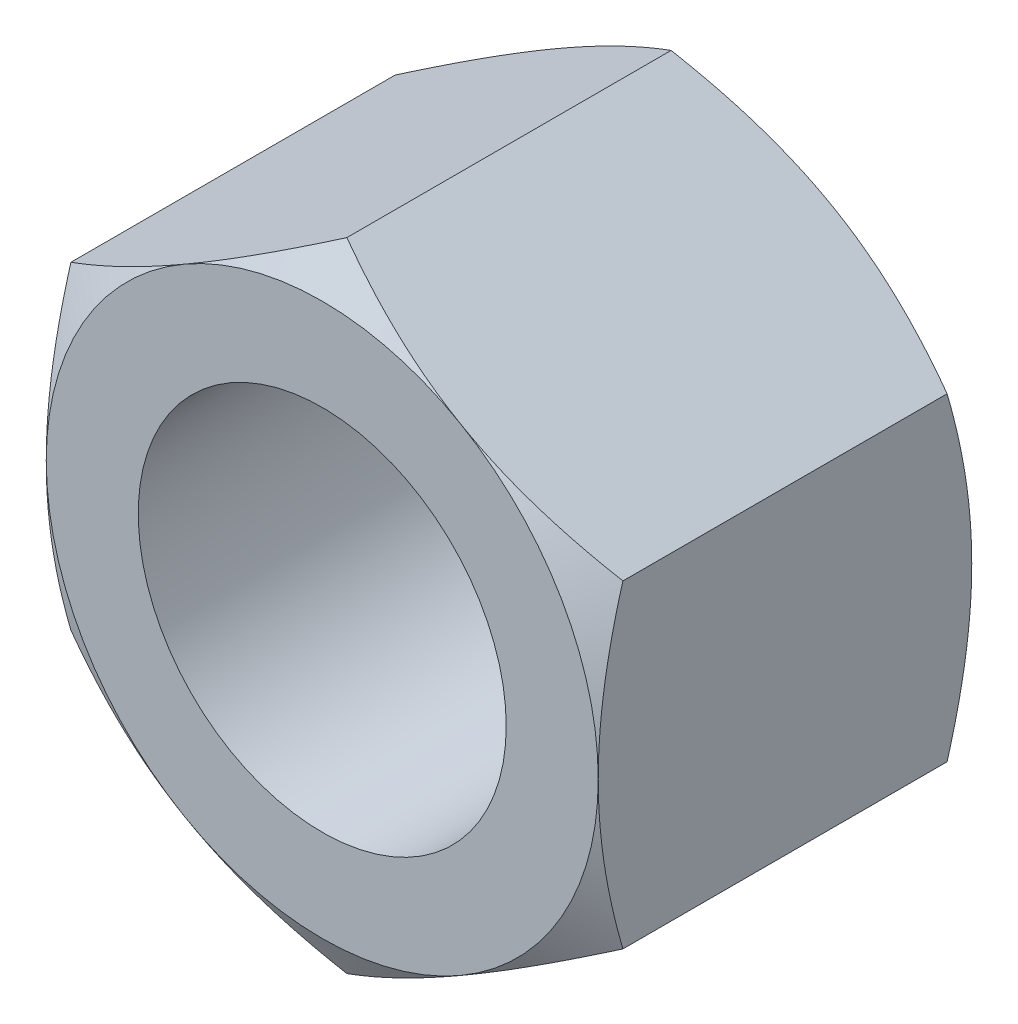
from build123d import *

# Parameters (mm, degrees)
BASE_EXTRUSION_DEPTH    = 20.3
ESQUISSE3_R             = 10
ENL_V_MAT_EXTRU_1_DEPTH = 31.611925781


with BuildPart() as part:
    # Esquisse1 → Base-Extrusion (new body)
    with BuildSketch(Plane.XY):
        Polygon((15, -8.660254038), (15, 8.660254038), (0, 17.320508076), (-15, 8.660254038), (-15, -8.660254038), (0, -17.320508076), align=None)
    extrude(amount=-BASE_EXTRUSION_DEPTH)

    # Esquisse2 → Enl_vement de mati_re-R_volution1 (revolve, cut)
    with BuildSketch(Plane(origin=(0, 0, 0), x_dir=(1, 0, 0), z_dir=(0, 1, 0)), mode=Mode.PRIVATE) as enl_vement_de_mati_re_r_volution1_sk:
        Polygon((-15, 0), (-33.580315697, 0), (-33.580315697, 20.3), (-15, 20.3), (-32.580315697, 10.15), align=None)
    revolve(enl_vement_de_mati_re_r_volution1_sk.sketch.rotate(Axis((0, 0, -20.3), (0, 0, 1)), 180), axis=Axis((0, 0, -20.3), (0, 0, 1)), mode=Mode.SUBTRACT)

    # Esquisse3 → Enl_v. mat.-Extru.1 (cut, through all)
    with BuildSketch(Plane.XY):
        Circle(ESQUISSE3_R)
    extrude(amount=-ENL_V_MAT_EXTRU_1_DEPTH, mode=Mode.SUBTRACT)


solid = part.part
